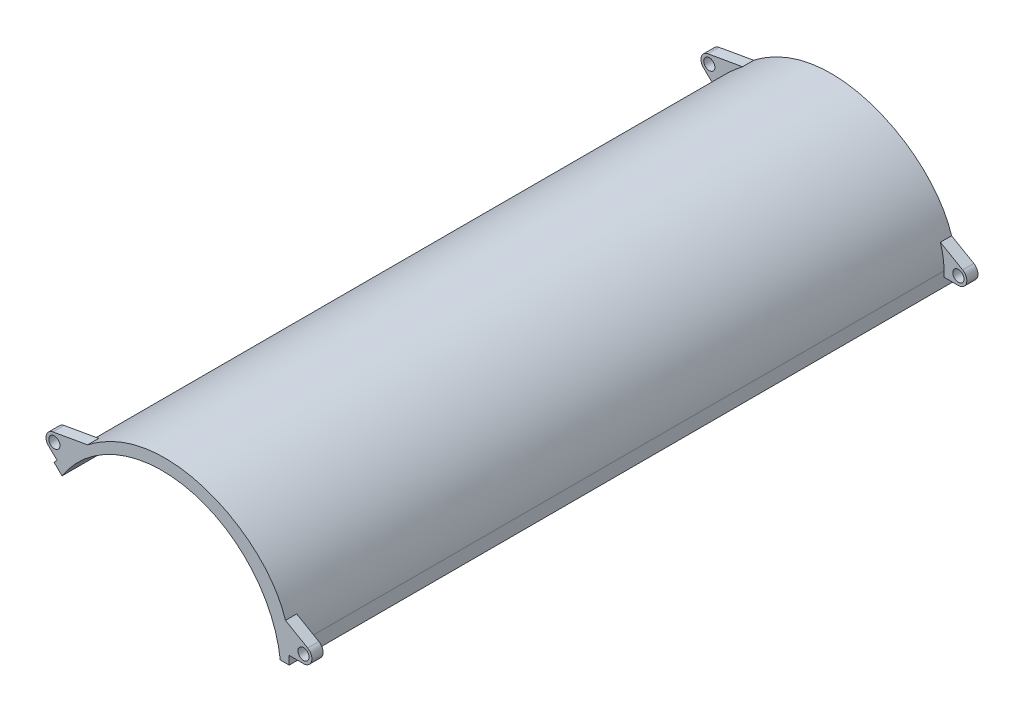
from build123d import *

# Parameters (mm, degrees)
BOSS_EXTRUDE1_DEPTH  = 595
BOSS_EXTRUDE13_START = -595
SKETCH3_R            = 10
BOSS_EXTRUDE13_DEPTH = 20
BOSS_EXTRUDE14_START = 575
SKETCH3_8_R          = 10
BOSS_EXTRUDE14_DEPTH = 20


with BuildPart() as part:
    # Sketch1 → Boss-Extrude1 (new, symmetric)
    with BuildSketch(Plane.XY):
        with BuildLine():
            Line((479.524287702, 25), (479.524287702, 50))
            add(Edge.make_bspline(
                [(69.720027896, 139.572690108), (108.18754722, 179.583185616), (152.416815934, 225.586540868), (219.133886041, 251.435560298), (287.408844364, 253.328836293), (359.356081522, 236.563554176), (477.15378099, 170.567422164), (479.524287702, 50)],
                knots=[0, 0, 0, 0, 0, 0, 0, 0, 1, 1, 1, 1, 1, 1, 1, 1], degree=7))
            Line((69.720027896, 139.572690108), (59.323974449, 128.759639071))
            Line((59.323974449, 128.759639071), (73.741375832, 114.898234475))
            ThreePointArc((73.741375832, 114.898234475), (300.256584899, 207.064141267), (463.524287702, 25))
            Line((463.524287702, 25), (479.524287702, 25))
        make_face()
    extrude(amount=BOSS_EXTRUDE1_DEPTH, both=True)

    # Sketch3 → Boss-Extrude13 (add)
    # profile 1 of 2: a face of its own
    with BuildSketch(Plane.XY.offset(BOSS_EXTRUDE13_START)):
        with BuildLine():
            Line((57.395277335, 174.772116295), (119.307330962, 185.688881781))
            add(Edge.make_bspline(
                [(69.720027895, 139.572690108), (76.074149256, 146.181682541), (82.585479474, 152.954189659), (89.329402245, 159.772367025), (96.35326765, 166.535005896), (103.683856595, 173.155904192), (111.333957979, 179.561593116), (119.307330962, 185.688881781)],
                knots=[0, 0, 0, 0, 0, 0, 0, 0, 0.165181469, 0.165181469, 0.165181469, 0.165181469, 0.165181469, 0.165181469, 0.165181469, 0.165181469], degree=7))
            Line((69.720027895, 139.572690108), (64.860756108, 134.518507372))
            Line((64.860756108, 134.518507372), (49.603946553, 149.186948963))
            ThreePointArc((49.603946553, 149.186948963), (45.650601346, 164.369754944), (57.395277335, 174.772116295))
        make_face()
        with Locations(Location((60, 160, 0), (0, 0, 180))):
            Circle(SKETCH3_R, mode=Mode.SUBTRACT)
    # profile 2 of 2: a face of its own
    with BuildSketch(Plane.XY.offset(BOSS_EXTRUDE13_START)):
        with BuildLine():
            Line((479.524287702, 50.000000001), (479.524287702, 40))
            Line((479.524287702, 40), (505, 40))
            ThreePointArc((505, 40), (519.488887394, 51.117714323), (512.5, 67.990381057))
            Line((512.5, 67.990381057), (472.826933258, 90.89563682))
            add(Edge.make_bspline(
                [(472.826933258, 90.89563682), (474.51705784, 85.487785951), (475.993797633, 79.937195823), (477.239796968, 74.242499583), (478.236465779, 68.402452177), (478.963896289, 62.415949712), (479.400774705, 56.282050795), (479.524287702, 50.000000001)],
                knots=[0.947895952, 0.947895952, 0.947895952, 0.947895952, 0.947895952, 0.947895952, 0.947895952, 0.947895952, 1, 1, 1, 1, 1, 1, 1, 1], degree=7))
        make_face()
        with Locations(Location((505, 55, 0), (0, 0, 180))):
            Circle(SKETCH3_R, mode=Mode.SUBTRACT)
    extrude(amount=BOSS_EXTRUDE13_DEPTH)

    # Sketch3_8 → Boss-Extrude14 (add)
    # profile 1 of 2: a face of its own
    with BuildSketch(Plane.XY.offset(BOSS_EXTRUDE14_START)):
        with BuildLine():
            Line((57.395277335, 174.772116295), (119.307330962, 185.688881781))
            add(Edge.make_bspline(
                [(69.720027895, 139.572690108), (76.074149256, 146.181682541), (82.585479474, 152.954189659), (89.329402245, 159.772367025), (96.35326765, 166.535005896), (103.683856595, 173.155904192), (111.333957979, 179.561593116), (119.307330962, 185.688881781)],
                knots=[0, 0, 0, 0, 0, 0, 0, 0, 0.165181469, 0.165181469, 0.165181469, 0.165181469, 0.165181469, 0.165181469, 0.165181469, 0.165181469], degree=7))
            Line((69.720027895, 139.572690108), (64.860756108, 134.518507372))
            Line((64.860756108, 134.518507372), (49.603946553, 149.186948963))
            ThreePointArc((49.603946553, 149.186948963), (45.650601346, 164.369754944), (57.395277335, 174.772116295))
        make_face()
        with Locations(Location((60, 160, 0), (0, 0, 180))):
            Circle(SKETCH3_8_R, mode=Mode.SUBTRACT)
    # profile 2 of 2: a face of its own
    with BuildSketch(Plane.XY.offset(BOSS_EXTRUDE14_START)):
        with BuildLine():
            Line((479.524287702, 50.000000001), (479.524287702, 40))
            Line((479.524287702, 40), (505, 40))
            ThreePointArc((505, 40), (519.488887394, 51.117714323), (512.5, 67.990381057))
            Line((512.5, 67.990381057), (472.826933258, 90.89563682))
            add(Edge.make_bspline(
                [(472.826933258, 90.89563682), (474.51705784, 85.487785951), (475.993797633, 79.937195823), (477.239796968, 74.242499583), (478.236465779, 68.402452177), (478.963896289, 62.415949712), (479.400774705, 56.282050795), (479.524287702, 50.000000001)],
                knots=[0.947895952, 0.947895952, 0.947895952, 0.947895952, 0.947895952, 0.947895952, 0.947895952, 0.947895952, 1, 1, 1, 1, 1, 1, 1, 1], degree=7))
        make_face()
        with Locations(Location((505, 55, 0), (0, 0, 180))):
            Circle(SKETCH3_8_R, mode=Mode.SUBTRACT)
    extrude(amount=BOSS_EXTRUDE14_DEPTH)


solid = part.part
